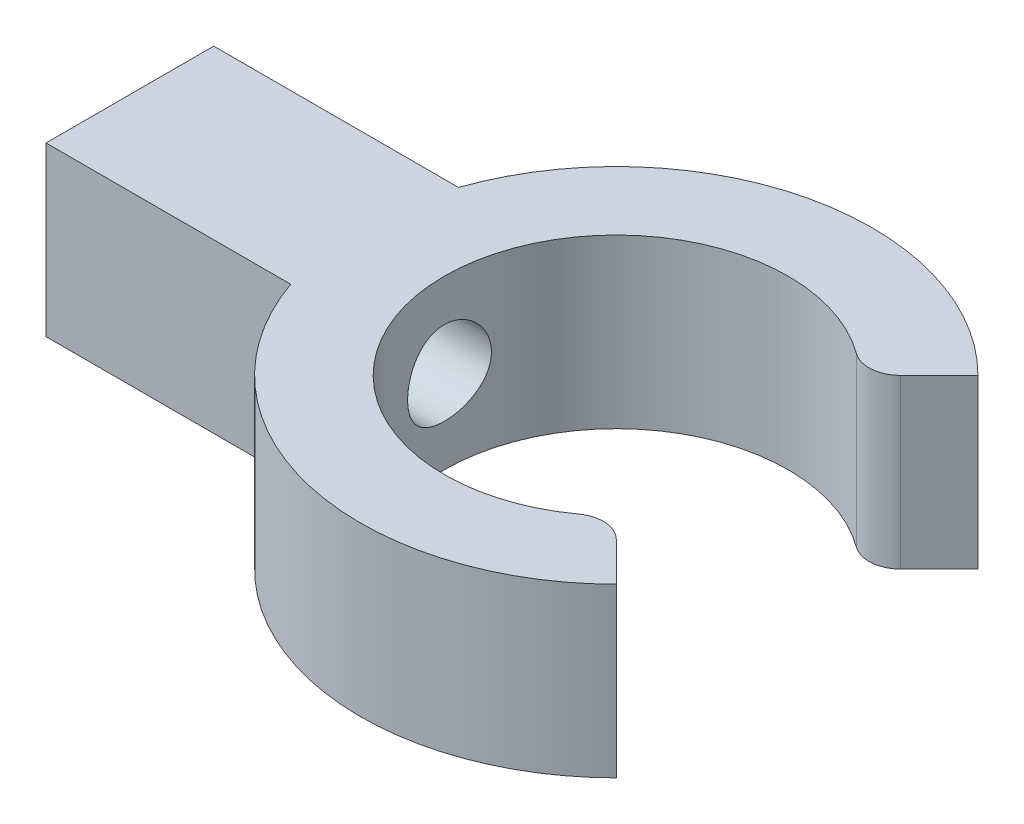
from build123d import *

# Parameters (mm, degrees)
BOSS_EXTRUDE1_DEPTH     = 8
FILLET1_R               = 1.5
CUT_EXTRUDE2_DEPTH      = 36.011126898
CUT_EXTRUDE2_DEPTH_BACK = 36.011126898
SKETCH2_R               = 2


with BuildPart() as part:
    # Sketch1 → Boss-Extrude1 (new body)
    with BuildSketch(Plane(origin=(0, 0, 0), x_dir=(1, 0, 0), z_dir=(0, 1, 0))):
        with BuildLine():
            Line((-7.5, -4), (4.174376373, -4))
            ThreePointArc((4.174376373, -4), (3.5, 0), (4.174376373, 4))
            Line((4.174376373, 4), (-7.5, 4))
            Line((-7.5, 4), (-7.5, -4))
        make_face()
        with BuildLine():
            Line((7.5, -4), (7.5, -1.2e-08))
            Line((7.5, -1.2e-08), (7.5, 4))
            Line((7.5, 4), (4.174376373, 4))
            ThreePointArc((4.174376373, 4), (3.5, 0), (4.174376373, -4))
            Line((4.174376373, -4), (7.5, -4))
        make_face()
        with BuildLine():
            Line((7.5, 4), (7.5, -1.2e-08))
            ThreePointArc((7.5, -1.2e-08), (12.561995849, 7.575812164), (21.498275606, 5.798275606))
            Line((21.498275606, 5.798275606), (24.32670273, 8.62670273))
            ThreePointArc((24.32670273, 8.62670273), (12.970067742, 11.890646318), (4.174376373, 4))
            Line((4.174376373, 4), (7.5, 4))
        make_face()
        with BuildLine():
            Line((24.32670273, -8.62670273), (21.498275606, -5.798275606))
            ThreePointArc((21.498275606, -5.798275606), (12.56199586, -7.575812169), (7.5, -1.2e-08))
            Line((7.5, -1.2e-08), (7.5, -4))
            Line((7.5, -4), (4.174376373, -4))
            ThreePointArc((4.174376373, -4), (12.970067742, -11.890646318), (24.32670273, -8.62670273))
        make_face()
    extrude(amount=BOSS_EXTRUDE1_DEPTH)

    # Fillet1
    fillet1_edges = [part.edges().sort_by_distance(p)[0] for p in [
        (21.498275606, 4, -5.798275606),
        (21.498275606, 4, 5.798275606),
    ]]
    fillet(fillet1_edges, radius=FILLET1_R)

    # Sketch2 → Cut-Extrude2 (cut, two sides: drawn at the far end of the back side and taken through both)
    with BuildSketch(Plane.ZY.offset(7.5).offset(-CUT_EXTRUDE2_DEPTH_BACK)):
        with Locations(Location((0, 4, 0), (0, 0, 180))):
            Circle(SKETCH2_R)
    extrude(amount=CUT_EXTRUDE2_DEPTH + CUT_EXTRUDE2_DEPTH_BACK, mode=Mode.SUBTRACT)


solid = part.part
